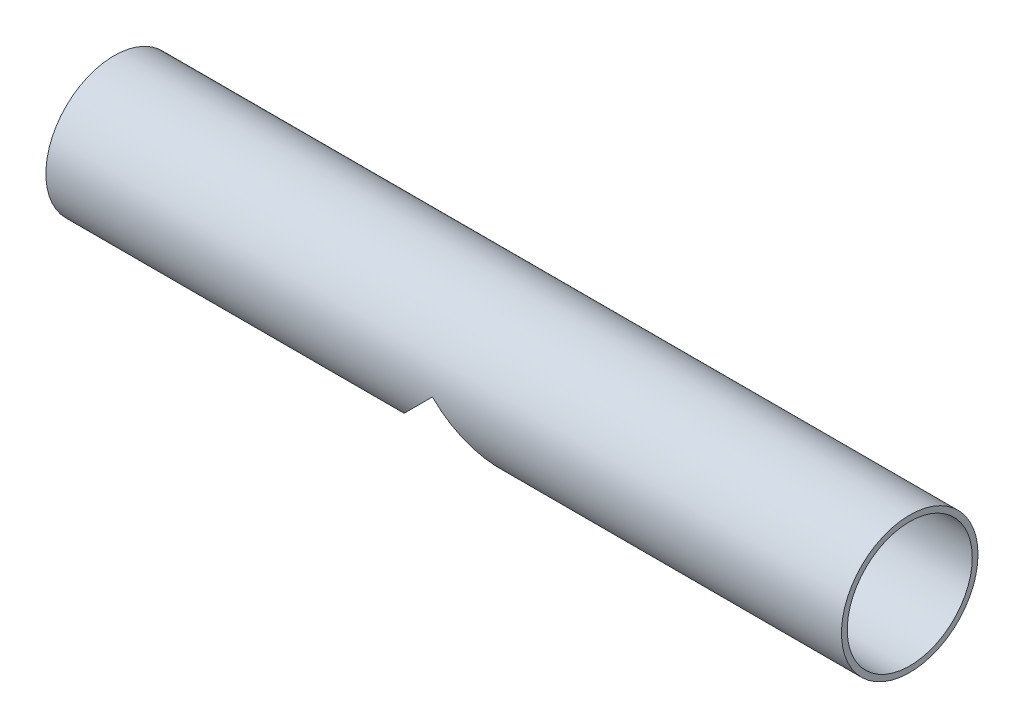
ISO-10303-21;
HEADER;
FILE_DESCRIPTION(('STEP AP214'),'2;1');
FILE_NAME('part.step','',(''),(''),'','','');
FILE_SCHEMA(('AUTOMOTIVE_DESIGN { 1 0 10303 214 1 1 1 1 }'));
ENDSEC;
DATA;
#1=APPLICATION_CONTEXT('core data for automotive mechanical design processes');
#2=APPLICATION_PROTOCOL_DEFINITION('international standard','automotive_design',2000,#1);
#3=PRODUCT_CONTEXT('',#1,'mechanical');
#4=PRODUCT('Part','Part','',(#3));
#5=PRODUCT_RELATED_PRODUCT_CATEGORY('part','',(#4));
#6=PRODUCT_DEFINITION_FORMATION('','',#4);
#7=PRODUCT_DEFINITION_CONTEXT('part definition',#1,'design');
#8=PRODUCT_DEFINITION('design','',#6,#7);
#9=PRODUCT_DEFINITION_SHAPE('','',#8);
#10=(LENGTH_UNIT() NAMED_UNIT(*) SI_UNIT(.MILLI.,.METRE.));
#11=(NAMED_UNIT(*) PLANE_ANGLE_UNIT() SI_UNIT($,.RADIAN.));
#12=(NAMED_UNIT(*) SI_UNIT($,.STERADIAN.) SOLID_ANGLE_UNIT());
#13=UNCERTAINTY_MEASURE_WITH_UNIT(LENGTH_MEASURE(1.E-05),#10,'distance_accuracy_value','');
#14=(GEOMETRIC_REPRESENTATION_CONTEXT(3) GLOBAL_UNCERTAINTY_ASSIGNED_CONTEXT((#13)) GLOBAL_UNIT_ASSIGNED_CONTEXT((#10,
#11,#12)) REPRESENTATION_CONTEXT('',''));
#15=CARTESIAN_POINT('',(0.,0.,0.));
#16=DIRECTION('',(0.,0.,1.));
#17=DIRECTION('',(1.,0.,0.));
#18=AXIS2_PLACEMENT_3D('',#15,#16,#17);
#19=CARTESIAN_POINT('',(443.5,0.,0.));
#20=DIRECTION('',(-1.,0.,0.));
#21=DIRECTION('',(0.,0.,1.));
#22=AXIS2_PLACEMENT_3D('',#19,#20,#21);
#23=CYLINDRICAL_SURFACE('',#22,34.85);
#24=CARTESIAN_POINT('',(215.452407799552,0.,0.));
#25=DIRECTION('',(0.707106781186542,0.707106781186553,0.));
#26=DIRECTION('',(-0.707106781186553,0.707106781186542,0.));
#27=AXIS2_PLACEMENT_3D('',#24,#25,#26);
#28=ELLIPSE('',#27,49.2853426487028,34.85);
#29=CARTESIAN_POINT('',(215.452407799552,0.,34.85));
#30=VERTEX_POINT('',#29);
#31=CARTESIAN_POINT('',(215.452407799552,0.,-34.85));
#32=VERTEX_POINT('',#31);
#33=EDGE_CURVE('E63',#30,#32,#28,.T.);
#34=ORIENTED_EDGE('',*,*,#33,.F.);
#35=CARTESIAN_POINT('',(215.452407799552,0.,0.));
#36=DIRECTION('',(-0.707106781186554,0.707106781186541,0.));
#37=DIRECTION('',(-0.707106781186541,-0.707106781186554,0.));
#38=AXIS2_PLACEMENT_3D('',#35,#36,#37);
#39=ELLIPSE('',#38,49.2853426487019,34.85);
#40=EDGE_CURVE('E65',#32,#30,#39,.T.);
#41=ORIENTED_EDGE('',*,*,#40,.F.);
#42=EDGE_LOOP('',(#34,#41));
#43=FACE_BOUND('',#42,.T.);
#44=CARTESIAN_POINT('',(443.5,0.,0.));
#45=DIRECTION('',(1.,0.,0.));
#46=DIRECTION('',(0.,0.,-1.));
#47=AXIS2_PLACEMENT_3D('',#44,#45,#46);
#48=CIRCLE('',#47,34.85);
#49=CARTESIAN_POINT('',(443.5,0.,-34.85));
#50=VERTEX_POINT('',#49);
#51=EDGE_CURVE('E78',#50,#50,#48,.T.);
#52=ORIENTED_EDGE('',*,*,#51,.T.);
#53=EDGE_LOOP('',(#52));
#54=FACE_BOUND('',#53,.T.);
#55=CARTESIAN_POINT('',(0.,0.,0.));
#56=DIRECTION('',(1.,0.,0.));
#57=DIRECTION('',(0.,0.,-1.));
#58=AXIS2_PLACEMENT_3D('',#55,#56,#57);
#59=CIRCLE('',#58,34.85);
#60=CARTESIAN_POINT('',(0.,0.,-34.85));
#61=VERTEX_POINT('',#60);
#62=EDGE_CURVE('E79',#61,#61,#59,.T.);
#63=ORIENTED_EDGE('',*,*,#62,.F.);
#64=EDGE_LOOP('',(#63));
#65=FACE_BOUND('',#64,.T.);
#66=ADVANCED_FACE('F32',(#43,#54,#65),#23,.F.);
#67=CARTESIAN_POINT('',(443.5,0.,0.));
#68=DIRECTION('',(-1.,0.,0.));
#69=DIRECTION('',(0.,0.,1.));
#70=AXIS2_PLACEMENT_3D('',#67,#68,#69);
#71=CYLINDRICAL_SURFACE('',#70,38.05);
#72=CARTESIAN_POINT('',(215.452407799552,0.,0.));
#73=DIRECTION('',(-0.707106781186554,0.707106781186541,0.));
#74=DIRECTION('',(-0.707106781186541,-0.707106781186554,0.));
#75=AXIS2_PLACEMENT_3D('',#72,#73,#74);
#76=ELLIPSE('',#75,53.8108260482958,38.05);
#77=CARTESIAN_POINT('',(215.452407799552,0.,-38.05));
#78=VERTEX_POINT('',#77);
#79=CARTESIAN_POINT('',(215.452407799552,0.,38.05));
#80=VERTEX_POINT('',#79);
#81=EDGE_CURVE('E39',#78,#80,#76,.T.);
#82=ORIENTED_EDGE('',*,*,#81,.T.);
#83=CARTESIAN_POINT('',(215.452407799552,0.,0.));
#84=DIRECTION('',(0.707106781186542,0.707106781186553,0.));
#85=DIRECTION('',(-0.707106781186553,0.707106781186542,0.));
#86=AXIS2_PLACEMENT_3D('',#83,#84,#85);
#87=ELLIPSE('',#86,53.8108260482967,38.05);
#88=EDGE_CURVE('E11',#80,#78,#87,.T.);
#89=ORIENTED_EDGE('',*,*,#88,.T.);
#90=EDGE_LOOP('',(#82,#89));
#91=FACE_BOUND('',#90,.T.);
#92=CARTESIAN_POINT('',(443.5,0.,0.));
#93=DIRECTION('',(1.,0.,0.));
#94=DIRECTION('',(0.,0.,-1.));
#95=AXIS2_PLACEMENT_3D('',#92,#93,#94);
#96=CIRCLE('',#95,38.05);
#97=CARTESIAN_POINT('',(443.5,0.,-38.05));
#98=VERTEX_POINT('',#97);
#99=EDGE_CURVE('E59',#98,#98,#96,.T.);
#100=ORIENTED_EDGE('',*,*,#99,.F.);
#101=EDGE_LOOP('',(#100));
#102=FACE_BOUND('',#101,.T.);
#103=CARTESIAN_POINT('',(0.,0.,0.));
#104=DIRECTION('',(1.,0.,0.));
#105=DIRECTION('',(0.,0.,-1.));
#106=AXIS2_PLACEMENT_3D('',#103,#104,#105);
#107=CIRCLE('',#106,38.05);
#108=CARTESIAN_POINT('',(0.,0.,-38.05));
#109=VERTEX_POINT('',#108);
#110=EDGE_CURVE('E76',#109,#109,#107,.T.);
#111=ORIENTED_EDGE('',*,*,#110,.T.);
#112=EDGE_LOOP('',(#111));
#113=FACE_BOUND('',#112,.T.);
#114=ADVANCED_FACE('F67',(#91,#102,#113),#71,.T.);
#115=CARTESIAN_POINT('',(443.5,0.,0.));
#116=DIRECTION('',(1.,0.,0.));
#117=DIRECTION('',(0.,0.,-1.));
#118=AXIS2_PLACEMENT_3D('',#115,#116,#117);
#119=PLANE('',#118);
#120=ORIENTED_EDGE('',*,*,#51,.F.);
#121=EDGE_LOOP('',(#120));
#122=FACE_BOUND('',#121,.T.);
#123=ORIENTED_EDGE('',*,*,#99,.T.);
#124=EDGE_LOOP('',(#123));
#125=FACE_BOUND('',#124,.T.);
#126=ADVANCED_FACE('F70',(#122,#125),#119,.T.);
#127=CARTESIAN_POINT('',(0.,0.,0.));
#128=DIRECTION('',(1.,0.,0.));
#129=DIRECTION('',(0.,0.,-1.));
#130=AXIS2_PLACEMENT_3D('',#127,#128,#129);
#131=PLANE('',#130);
#132=ORIENTED_EDGE('',*,*,#62,.T.);
#133=EDGE_LOOP('',(#132));
#134=FACE_BOUND('',#133,.T.);
#135=ORIENTED_EDGE('',*,*,#110,.F.);
#136=EDGE_LOOP('',(#135));
#137=FACE_BOUND('',#136,.T.);
#138=ADVANCED_FACE('F95',(#134,#137),#131,.F.);
#139=CARTESIAN_POINT('',(215.452407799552,0.,-40.));
#140=DIRECTION('',(0.707106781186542,0.707106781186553,0.));
#141=DIRECTION('',(-0.707106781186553,0.707106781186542,0.));
#142=AXIS2_PLACEMENT_3D('',#139,#140,#141);
#143=PLANE('',#142);
#144=ORIENTED_EDGE('',*,*,#33,.T.);
#145=DIRECTION('',(0.,0.,1.));
#146=VECTOR('',#145,1.);
#147=CARTESIAN_POINT('',(215.452407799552,0.,-40.));
#148=LINE('',#147,#146);
#149=EDGE_CURVE('E46',#78,#32,#148,.T.);
#150=ORIENTED_EDGE('',*,*,#149,.F.);
#151=ORIENTED_EDGE('',*,*,#88,.F.);
#152=EDGE_CURVE('E51',#30,#80,#148,.T.);
#153=ORIENTED_EDGE('',*,*,#152,.F.);
#154=EDGE_LOOP('',(#144,#150,#151,#153));
#155=FACE_BOUND('',#154,.T.);
#156=ADVANCED_FACE('F61',(#155),#143,.F.);
#157=CARTESIAN_POINT('',(215.452407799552,0.,-40.));
#158=DIRECTION('',(-0.707106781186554,0.707106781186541,0.));
#159=DIRECTION('',(-0.707106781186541,-0.707106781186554,0.));
#160=AXIS2_PLACEMENT_3D('',#157,#158,#159);
#161=PLANE('',#160);
#162=ORIENTED_EDGE('',*,*,#40,.T.);
#163=ORIENTED_EDGE('',*,*,#152,.T.);
#164=ORIENTED_EDGE('',*,*,#81,.F.);
#165=ORIENTED_EDGE('',*,*,#149,.T.);
#166=EDGE_LOOP('',(#162,#163,#164,#165));
#167=FACE_BOUND('',#166,.T.);
#168=ADVANCED_FACE('F57',(#167),#161,.F.);
#169=CLOSED_SHELL('',(#66,#114,#126,#138,#156,#168));
#170=MANIFOLD_SOLID_BREP('B2',#169);
#171=ADVANCED_BREP_SHAPE_REPRESENTATION('',(#18,#170),#14);
#172=SHAPE_DEFINITION_REPRESENTATION(#9,#171);
ENDSEC;
END-ISO-10303-21;
